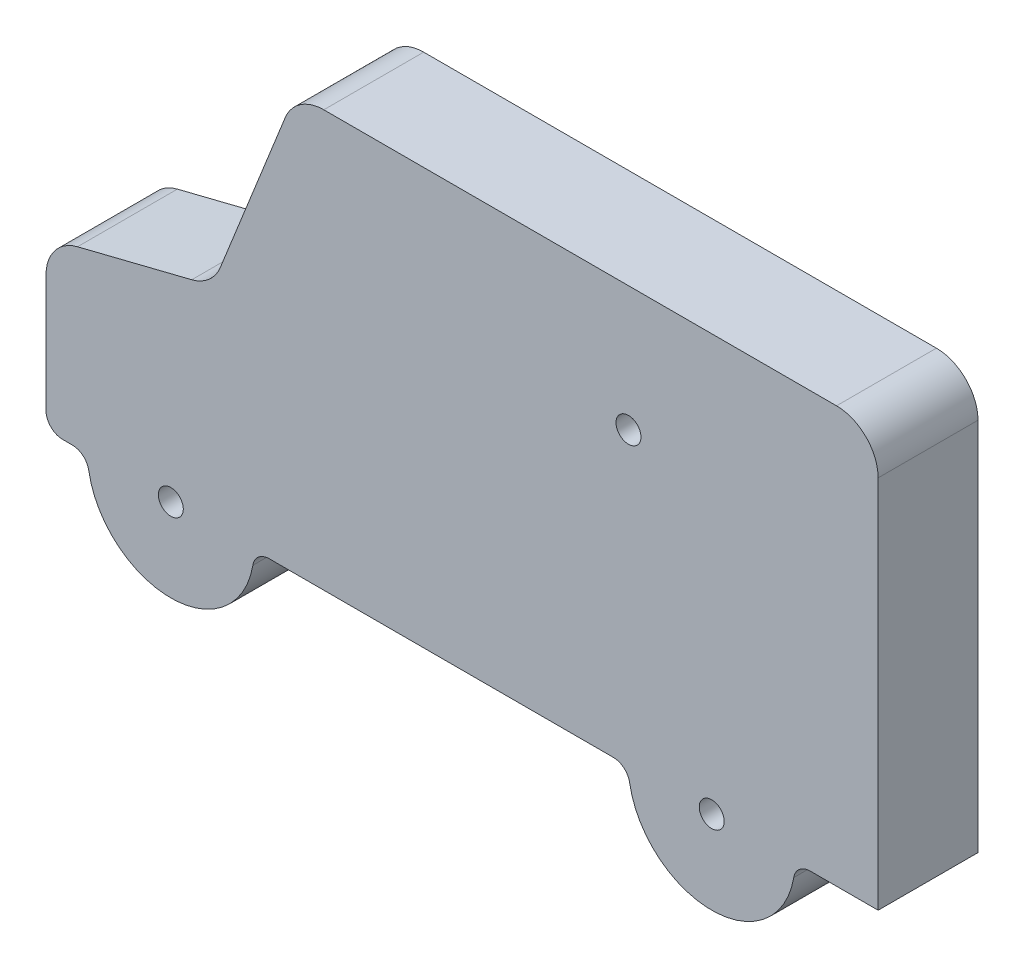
from build123d import *

# Parameters (mm, degrees)
ESQUISSE1_R             = 1.5
EXTRUSION1_DEPTH        = 12
ESQUISSE2_R             = 1.5
ENL_V_MAT_EXTRU_1_DEPTH = 11


with BuildPart() as part:
    # Esquisse1 → Extrusion1 (new body)
    with BuildSketch(Plane.XY):
        with BuildLine():
            Line((3.787321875, 20.946830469), (17.519775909, 24.379943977))
            ThreePointArc((17.519775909, 24.379943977), (19.595119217, 25.463838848), (20.949481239, 27.373703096))
            Line((20.949481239, 27.373703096), (28.742781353, 46.856953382))
            ThreePointArc((28.742781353, 46.856953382), (30.582020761, 49.140336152), (33.385164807, 50))
            Line((33.385164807, 50), (95, 50))
            ThreePointArc((95, 50), (98.535533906, 48.535533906), (100, 45))
            Line((100, 45), (100, 0))
            Line((100, 0), (91.832159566, 0))
            ThreePointArc((91.832159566, 0), (90.541165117, -0.472474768), (89.860132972, -1.666666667))
            ThreePointArc((89.860132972, -1.666666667), (80, -10), (70.139867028, -1.666666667))
            ThreePointArc((70.139867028, -1.666666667), (69.458834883, -0.472474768), (68.167840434, 0))
            Line((68.167840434, 0), (26.832159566, 0))
            ThreePointArc((26.832159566, 0), (25.541165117, -0.472474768), (24.860132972, -1.666666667))
            ThreePointArc((24.860132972, -1.666666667), (15, -10), (5.139867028, -1.666666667))
            ThreePointArc((5.139867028, -1.666666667), (4.458834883, -0.472474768), (3.167840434, 0))
            Line((3.167840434, 0), (2, 0))
            ThreePointArc((2, 0), (0.585786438, 0.585786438), (0, 2))
            Line((0, 2), (0, 16.096117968))
            ThreePointArc((0, 16.096117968), (1.05897281, 19.173179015), (3.787321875, 20.946830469))
        make_face()
        with Locations((15, 0)):
            Circle(ESQUISSE1_R, mode=Mode.SUBTRACT)
        with Locations((80, 0)):
            Circle(ESQUISSE1_R, mode=Mode.SUBTRACT)
    extrude(amount=EXTRUSION1_DEPTH)

    # Esquisse2 → Enl_v. mat.-Extru.1 (cut)
    with BuildSketch(Plane.XY.offset(12)):
        with Locations((70, 35)):
            Circle(ESQUISSE2_R)
    extrude(amount=-ENL_V_MAT_EXTRU_1_DEPTH, mode=Mode.SUBTRACT)


solid = part.part
